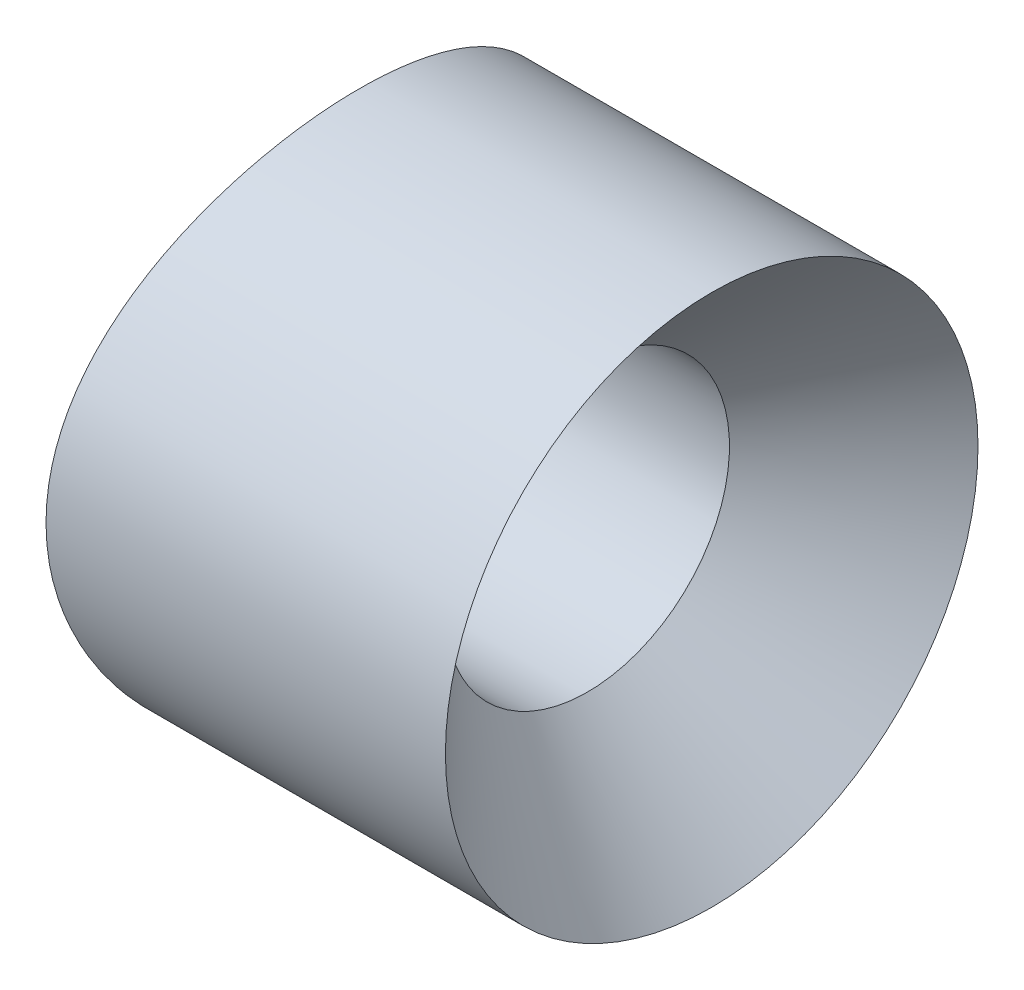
ISO-10303-21;
HEADER;
FILE_DESCRIPTION(('STEP AP214'),'2;1');
FILE_NAME('part.step','',(''),(''),'','','');
FILE_SCHEMA(('AUTOMOTIVE_DESIGN { 1 0 10303 214 1 1 1 1 }'));
ENDSEC;
DATA;
#1=APPLICATION_CONTEXT('core data for automotive mechanical design processes');
#2=APPLICATION_PROTOCOL_DEFINITION('international standard','automotive_design',2000,#1);
#3=PRODUCT_CONTEXT('',#1,'mechanical');
#4=PRODUCT('Part','Part','',(#3));
#5=PRODUCT_RELATED_PRODUCT_CATEGORY('part','',(#4));
#6=PRODUCT_DEFINITION_FORMATION('','',#4);
#7=PRODUCT_DEFINITION_CONTEXT('part definition',#1,'design');
#8=PRODUCT_DEFINITION('design','',#6,#7);
#9=PRODUCT_DEFINITION_SHAPE('','',#8);
#10=(LENGTH_UNIT() NAMED_UNIT(*) SI_UNIT(.MILLI.,.METRE.));
#11=(NAMED_UNIT(*) PLANE_ANGLE_UNIT() SI_UNIT($,.RADIAN.));
#12=(NAMED_UNIT(*) SI_UNIT($,.STERADIAN.) SOLID_ANGLE_UNIT());
#13=UNCERTAINTY_MEASURE_WITH_UNIT(LENGTH_MEASURE(1.E-05),#10,'distance_accuracy_value','');
#14=(GEOMETRIC_REPRESENTATION_CONTEXT(3) GLOBAL_UNCERTAINTY_ASSIGNED_CONTEXT((#13)) GLOBAL_UNIT_ASSIGNED_CONTEXT((#10,
#11,#12)) REPRESENTATION_CONTEXT('',''));
#15=CARTESIAN_POINT('',(0.,0.,0.));
#16=DIRECTION('',(0.,0.,1.));
#17=DIRECTION('',(1.,0.,0.));
#18=AXIS2_PLACEMENT_3D('',#15,#16,#17);
#19=CARTESIAN_POINT('',(0.,0.,0.));
#20=DIRECTION('',(-1.,0.,0.));
#21=DIRECTION('',(0.,0.,1.));
#22=AXIS2_PLACEMENT_3D('',#19,#20,#21);
#23=CYLINDRICAL_SURFACE('',#22,3.);
#24=CARTESIAN_POINT('',(0.,0.,3.));
#25=CARTESIAN_POINT('',(-1.24782056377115E-06,-0.163165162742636,3.00000157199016));
#26=CARTESIAN_POINT('',(0.00487986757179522,-0.326319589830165,2.98664366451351));
#27=CARTESIAN_POINT('',(0.023769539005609,-0.647779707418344,2.93375586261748));
#28=CARTESIAN_POINT('',(0.037779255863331,-0.806084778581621,2.89422263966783));
#29=CARTESIAN_POINT('',(0.0731588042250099,-1.11313423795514,2.7905463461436));
#30=CARTESIAN_POINT('',(0.0945136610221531,-1.2618973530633,2.72645331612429));
#31=CARTESIAN_POINT('',(0.142155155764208,-1.54660971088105,2.57564891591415));
#32=CARTESIAN_POINT('',(0.168442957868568,-1.68255591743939,2.488932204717));
#33=CARTESIAN_POINT('',(0.224195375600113,-1.94334201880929,2.29153844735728));
#34=CARTESIAN_POINT('',(0.253741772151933,-2.06758095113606,2.18009034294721));
#35=CARTESIAN_POINT('',(0.311992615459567,-2.29601754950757,1.93804128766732));
#36=CARTESIAN_POINT('',(0.340696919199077,-2.40021182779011,1.80743710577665));
#37=CARTESIAN_POINT('',(0.394980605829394,-2.58835703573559,1.52635966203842));
#38=CARTESIAN_POINT('',(0.420452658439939,-2.67167420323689,1.37543961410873));
#39=CARTESIAN_POINT('',(0.464434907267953,-2.81149862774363,1.06070810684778));
#40=CARTESIAN_POINT('',(0.482947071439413,-2.86801346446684,0.896900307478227));
#41=CARTESIAN_POINT('',(0.510344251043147,-2.95057902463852,0.567347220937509));
#42=CARTESIAN_POINT('',(0.519554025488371,-2.97766012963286,0.401887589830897));
#43=CARTESIAN_POINT('',(0.528463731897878,-3.00387011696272,0.0685334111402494));
#44=CARTESIAN_POINT('',(0.528166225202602,-3.00300652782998,-0.0993604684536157));
#45=CARTESIAN_POINT('',(0.518312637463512,-2.97399594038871,-0.425508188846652));
#46=CARTESIAN_POINT('',(0.509136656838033,-2.94696900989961,-0.583875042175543));
#47=CARTESIAN_POINT('',(0.483038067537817,-2.86825669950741,-0.89367358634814));
#48=CARTESIAN_POINT('',(0.466114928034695,-2.81656962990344,-1.04510480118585));
#49=CARTESIAN_POINT('',(0.425949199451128,-2.68937437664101,-1.33913205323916));
#50=CARTESIAN_POINT('',(0.40262471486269,-2.61355530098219,-1.48158195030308));
#51=CARTESIAN_POINT('',(0.352072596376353,-2.44050742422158,-1.75206150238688));
#52=CARTESIAN_POINT('',(0.324843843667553,-2.34327248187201,-1.88008700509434));
#53=CARTESIAN_POINT('',(0.267764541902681,-2.12455058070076,-2.12473739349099));
#54=CARTESIAN_POINT('',(0.237850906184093,-2.00210720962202,-2.24049377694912));
#55=CARTESIAN_POINT('',(0.179890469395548,-1.73930295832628,-2.45011918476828));
#56=CARTESIAN_POINT('',(0.151843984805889,-1.59893905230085,-2.54398450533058));
#57=CARTESIAN_POINT('',(0.100438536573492,-1.30141077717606,-2.70844134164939));
#58=CARTESIAN_POINT('',(0.0771590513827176,-1.14401953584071,-2.77864916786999));
#59=CARTESIAN_POINT('',(0.0388417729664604,-0.818653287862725,-2.89126400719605));
#60=CARTESIAN_POINT('',(0.0238003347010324,-0.650682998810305,-2.9336833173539));
#61=CARTESIAN_POINT('',(0.00449299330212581,-0.317371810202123,-2.98771308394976));
#62=CARTESIAN_POINT('',(-0.000245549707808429,-0.152277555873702,-3.0006761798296));
#63=CARTESIAN_POINT('',(0.000265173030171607,0.17776029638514,-2.99926970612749));
#64=CARTESIAN_POINT('',(0.00551251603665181,0.342703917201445,-2.9849053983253));
#65=CARTESIAN_POINT('',(0.0249309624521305,0.661474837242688,-2.93046946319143));
#66=CARTESIAN_POINT('',(0.0387693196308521,0.815488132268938,-2.8913553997));
#67=CARTESIAN_POINT('',(0.0734394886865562,1.11472845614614,-2.78968886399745));
#68=CARTESIAN_POINT('',(0.0942725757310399,1.25995387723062,-2.72713211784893));
#69=CARTESIAN_POINT('',(0.14143024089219,1.54277896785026,-2.57802720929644));
#70=CARTESIAN_POINT('',(0.16791255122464,1.67997217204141,-2.49075931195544));
#71=CARTESIAN_POINT('',(0.223086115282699,1.93825512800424,-2.29551598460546));
#72=CARTESIAN_POINT('',(0.251778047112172,2.05933990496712,-2.18753418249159));
#73=CARTESIAN_POINT('',(0.309897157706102,2.28831731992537,-1.94743170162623));
#74=CARTESIAN_POINT('',(0.339287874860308,2.39523002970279,-1.81436483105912));
#75=CARTESIAN_POINT('',(0.39406560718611,2.58528122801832,-1.531454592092));
#76=CARTESIAN_POINT('',(0.419452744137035,2.66842043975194,-1.38161173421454));
#77=CARTESIAN_POINT('',(0.463257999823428,2.80782850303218,-1.07006091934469));
#78=CARTESIAN_POINT('',(0.481718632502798,2.86426184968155,-0.908432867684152));
#79=CARTESIAN_POINT('',(0.509771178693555,2.94889793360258,-0.577222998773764));
#80=CARTESIAN_POINT('',(0.51936645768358,2.97711138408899,-0.407644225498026));
#81=CARTESIAN_POINT('',(0.528341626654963,3.0035080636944,-0.0742898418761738));
#82=CARTESIAN_POINT('',(0.52819907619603,3.00309516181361,0.0893629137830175));
#83=CARTESIAN_POINT('',(0.518902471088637,2.97573966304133,0.41415882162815));
#84=CARTESIAN_POINT('',(0.509749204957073,2.94879938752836,0.575302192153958));
#85=CARTESIAN_POINT('',(0.483642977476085,2.87009705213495,0.887726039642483));
#86=CARTESIAN_POINT('',(0.466827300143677,2.81877123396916,1.03912870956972));
#87=CARTESIAN_POINT('',(0.427129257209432,2.693163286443,1.33122524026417));
#88=CARTESIAN_POINT('',(0.404245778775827,2.61887694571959,1.47191713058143));
#89=CARTESIAN_POINT('',(0.353676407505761,2.44621457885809,1.74442926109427));
#90=CARTESIAN_POINT('',(0.325841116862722,2.34703071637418,1.87570954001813));
#91=CARTESIAN_POINT('',(0.268842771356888,2.1287445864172,2.12021781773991));
#92=CARTESIAN_POINT('',(0.239679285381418,2.00963581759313,2.23343990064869));
#93=CARTESIAN_POINT('',(0.181864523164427,1.74898006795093,2.44340220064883));
#94=CARTESIAN_POINT('',(0.153284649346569,1.60670738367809,2.53926413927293));
#95=CARTESIAN_POINT('',(0.101339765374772,1.30717474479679,2.70566588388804));
#96=CARTESIAN_POINT('',(0.0779736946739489,1.14991784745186,2.77621084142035));
#97=CARTESIAN_POINT('',(0.040017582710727,0.829587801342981,2.88784993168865));
#98=CARTESIAN_POINT('',(0.025185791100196,0.66682963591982,2.92976238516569));
#99=CARTESIAN_POINT('',(0.00517952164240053,0.336042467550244,2.98583120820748));
#100=CARTESIAN_POINT('',(1.28491428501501E-06,0.168015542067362,2.9999983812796));
#101=CARTESIAN_POINT('',(0.,0.,3.));
#102=B_SPLINE_CURVE_WITH_KNOTS('',3,(#24,#25,#26,#27,#28,#29,#30,#31,#32,#33,#34,#35,#36,#37,
#38,#39,#40,#41,#42,#43,#44,#45,#46,#47,#48,#49,#50,#51,#52,#53,#54,#55,#56,#57,#58,#59,#60,#61,
#62,#63,#64,#65,#66,#67,#68,#69,#70,#71,#72,#73,#74,#75,#76,#77,#78,#79,#80,#81,#82,#83,#84,#85,
#86,#87,#88,#89,#90,#91,#92,#93,#94,#95,#96,#97,#98,#99,#100,#101),.UNSPECIFIED.,.T.,.F.,(4,2,2,
2,2,2,2,2,2,2,2,2,2,2,2,2,2,2,2,2,2,2,2,2,2,2,2,2,2,2,2,2,2,2,2,2,2,2,4),(0.,0.488872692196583,
0.977807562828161,1.46575148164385,1.95381069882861,2.46001835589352,2.96631149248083,
3.48649402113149,4.00652935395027,4.50770706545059,5.0087497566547,5.48924976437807,
5.96978270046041,6.45677555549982,6.94390824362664,7.45496090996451,7.96609997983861,
8.48516940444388,9.00400897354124,9.49849543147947,9.99288668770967,10.4692306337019,
10.9456614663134,11.4377220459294,11.9299342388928,12.4470984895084,12.9642470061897,
13.4781672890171,13.9918923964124,14.4804425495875,14.9689499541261,15.4490296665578,
15.929197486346,16.4276038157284,16.9261730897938,17.4454191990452,17.9645595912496,
18.4681610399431,18.9715663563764),.UNSPECIFIED.);
#103=CARTESIAN_POINT('',(0.,0.,3.));
#104=VERTEX_POINT('',#103);
#105=EDGE_CURVE('E46',#104,#104,#102,.T.);
#106=ORIENTED_EDGE('',*,*,#105,.T.);
#107=EDGE_LOOP('',(#106));
#108=FACE_BOUND('',#107,.T.);
#109=CARTESIAN_POINT('',(4.5,0.,0.));
#110=DIRECTION('',(-1.,0.,0.));
#111=DIRECTION('',(0.,0.,1.));
#112=AXIS2_PLACEMENT_3D('',#109,#110,#111);
#113=CIRCLE('',#112,3.);
#114=CARTESIAN_POINT('',(4.5,0.,3.));
#115=VERTEX_POINT('',#114);
#116=EDGE_CURVE('E10',#115,#115,#113,.T.);
#117=ORIENTED_EDGE('',*,*,#116,.T.);
#118=EDGE_LOOP('',(#117));
#119=FACE_BOUND('',#118,.T.);
#120=ADVANCED_FACE('F30',(#108,#119),#23,.T.);
#121=CARTESIAN_POINT('',(3.10000000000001,0.,0.));
#122=DIRECTION('',(1.,0.,0.));
#123=DIRECTION('',(0.,0.,-1.));
#124=AXIS2_PLACEMENT_3D('',#121,#122,#123);
#125=CONICAL_SURFACE('',#124,1.6,0.78539816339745);
#126=ORIENTED_EDGE('',*,*,#116,.F.);
#127=EDGE_LOOP('',(#126));
#128=FACE_BOUND('',#127,.T.);
#129=CARTESIAN_POINT('',(3.10000000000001,0.,0.));
#130=DIRECTION('',(-1.,0.,0.));
#131=DIRECTION('',(0.,0.,1.));
#132=AXIS2_PLACEMENT_3D('',#129,#130,#131);
#133=CIRCLE('',#132,1.6);
#134=CARTESIAN_POINT('',(3.10000000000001,0.,1.6));
#135=VERTEX_POINT('',#134);
#136=EDGE_CURVE('E42',#135,#135,#133,.T.);
#137=ORIENTED_EDGE('',*,*,#136,.T.);
#138=EDGE_LOOP('',(#137));
#139=FACE_BOUND('',#138,.T.);
#140=ADVANCED_FACE('F60',(#128,#139),#125,.F.);
#141=CARTESIAN_POINT('',(0.,0.,0.));
#142=DIRECTION('',(-1.,0.,0.));
#143=DIRECTION('',(0.,0.,1.));
#144=AXIS2_PLACEMENT_3D('',#141,#142,#143);
#145=CYLINDRICAL_SURFACE('',#144,1.6);
#146=CARTESIAN_POINT('',(0.380475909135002,0.,1.6));
#147=CARTESIAN_POINT('',(0.380477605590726,0.0890720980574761,1.59999653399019));
#148=CARTESIAN_POINT('',(0.381866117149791,0.178189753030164,1.59253680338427));
#149=CARTESIAN_POINT('',(0.387263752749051,0.353915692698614,1.56291305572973));
#150=CARTESIAN_POINT('',(0.391275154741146,0.440521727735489,1.54073625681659));
#151=CARTESIAN_POINT('',(0.401449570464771,0.608656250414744,1.48237895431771));
#152=CARTESIAN_POINT('',(0.407610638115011,0.690189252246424,1.44621111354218));
#153=CARTESIAN_POINT('',(0.421387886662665,0.846023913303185,1.36093140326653));
#154=CARTESIAN_POINT('',(0.429003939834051,0.920326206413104,1.31182066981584));
#155=CARTESIAN_POINT('',(0.444932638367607,1.0604667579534,1.20143619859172));
#156=CARTESIAN_POINT('',(0.453251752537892,1.12620805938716,1.14004028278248));
#157=CARTESIAN_POINT('',(0.469591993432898,1.24651645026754,1.00709231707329));
#158=CARTESIAN_POINT('',(0.477613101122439,1.3010828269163,0.935539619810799));
#159=CARTESIAN_POINT('',(0.49252263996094,1.39786185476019,0.783674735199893));
#160=CARTESIAN_POINT('',(0.499402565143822,1.43998341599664,0.70330359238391));
#161=CARTESIAN_POINT('',(0.511182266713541,1.51009066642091,0.536479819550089));
#162=CARTESIAN_POINT('',(0.516082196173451,1.53807744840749,0.450027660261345));
#163=CARTESIAN_POINT('',(0.523304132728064,1.57882178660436,0.274499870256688));
#164=CARTESIAN_POINT('',(0.525653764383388,1.59174265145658,0.185463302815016));
#165=CARTESIAN_POINT('',(0.527605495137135,1.60249693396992,0.0064571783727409));
#166=CARTESIAN_POINT('',(0.527207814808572,1.60033156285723,-0.0835123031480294));
#167=CARTESIAN_POINT('',(0.523731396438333,1.58110068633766,-0.260711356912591));
#168=CARTESIAN_POINT('',(0.520684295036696,1.56421099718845,-0.347960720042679));
#169=CARTESIAN_POINT('',(0.512286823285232,1.5162886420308,-0.518365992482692));
#170=CARTESIAN_POINT('',(0.506936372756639,1.48525548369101,-0.601521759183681));
#171=CARTESIAN_POINT('',(0.494480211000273,1.40975755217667,-0.761892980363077));
#172=CARTESIAN_POINT('',(0.487365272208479,1.36522188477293,-0.839074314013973));
#173=CARTESIAN_POINT('',(0.472168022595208,1.26403528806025,-0.984934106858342));
#174=CARTESIAN_POINT('',(0.464085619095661,1.2073831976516,-1.05361175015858));
#175=CARTESIAN_POINT('',(0.447712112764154,1.08260123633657,-1.18155556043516));
#176=CARTESIAN_POINT('',(0.439419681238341,1.01431758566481,-1.24067167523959));
#177=CARTESIAN_POINT('',(0.423672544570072,0.868724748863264,-1.34663417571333));
#178=CARTESIAN_POINT('',(0.416217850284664,0.791415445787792,-1.39348040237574));
#179=CARTESIAN_POINT('',(0.402988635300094,0.629773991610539,-1.47361230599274));
#180=CARTESIAN_POINT('',(0.397216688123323,0.545431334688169,-1.50687724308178));
#181=CARTESIAN_POINT('',(0.388046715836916,0.372226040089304,-1.55872301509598));
#182=CARTESIAN_POINT('',(0.384648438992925,0.283363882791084,-1.5773054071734));
#183=CARTESIAN_POINT('',(0.380660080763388,0.104992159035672,-1.59904174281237));
#184=CARTESIAN_POINT('',(0.380030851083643,0.0155096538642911,-1.60241078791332));
#185=CARTESIAN_POINT('',(0.381547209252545,-0.162739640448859,-1.5942004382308));
#186=CARTESIAN_POINT('',(0.383692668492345,-0.251506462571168,-1.58262173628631));
#187=CARTESIAN_POINT('',(0.39048028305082,-0.425104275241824,-1.54502887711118));
#188=CARTESIAN_POINT('',(0.395103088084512,-0.509960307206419,-1.51912655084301));
#189=CARTESIAN_POINT('',(0.406307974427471,-0.674127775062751,-1.45373998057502));
#190=CARTESIAN_POINT('',(0.412890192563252,-0.753438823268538,-1.41425478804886));
#191=CARTESIAN_POINT('',(0.427361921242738,-0.905215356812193,-1.32232468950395));
#192=CARTESIAN_POINT('',(0.435264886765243,-0.977596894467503,-1.26974334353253));
#193=CARTESIAN_POINT('',(0.451449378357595,-1.1125869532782,-1.15329843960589));
#194=CARTESIAN_POINT('',(0.459730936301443,-1.17519464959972,-1.0894339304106));
#195=CARTESIAN_POINT('',(0.475864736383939,-1.28965827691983,-0.951277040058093));
#196=CARTESIAN_POINT('',(0.483710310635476,-1.34136988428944,-0.876864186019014));
#197=CARTESIAN_POINT('',(0.497977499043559,-1.4315570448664,-0.720282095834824));
#198=CARTESIAN_POINT('',(0.504399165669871,-1.47003308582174,-0.63811314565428));
#199=CARTESIAN_POINT('',(0.515066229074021,-1.53243843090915,-0.468758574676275));
#200=CARTESIAN_POINT('',(0.519322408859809,-1.55643992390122,-0.38160026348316));
#201=CARTESIAN_POINT('',(0.525224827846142,-1.58944587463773,-0.204405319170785));
#202=CARTESIAN_POINT('',(0.526871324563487,-1.59845181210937,-0.114368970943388));
#203=CARTESIAN_POINT('',(0.527364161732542,-1.60116201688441,0.0646396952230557));
#204=CARTESIAN_POINT('',(0.526250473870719,-1.59508471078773,0.153608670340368));
#205=CARTESIAN_POINT('',(0.52143071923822,-1.56827764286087,0.329235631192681));
#206=CARTESIAN_POINT('',(0.517724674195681,-1.54754800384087,0.415893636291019));
#207=CARTESIAN_POINT('',(0.508136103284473,-1.49211447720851,0.584332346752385));
#208=CARTESIAN_POINT('',(0.502256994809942,-1.45743252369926,0.666120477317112));
#209=CARTESIAN_POINT('',(0.488960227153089,-1.37510447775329,0.822749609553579));
#210=CARTESIAN_POINT('',(0.481542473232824,-1.32745758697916,0.897590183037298));
#211=CARTESIAN_POINT('',(0.465861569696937,-1.21979388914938,1.03929167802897));
#212=CARTESIAN_POINT('',(0.457588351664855,-1.15961864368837,1.10603111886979));
#213=CARTESIAN_POINT('',(0.441194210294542,-1.02893638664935,1.22854097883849));
#214=CARTESIAN_POINT('',(0.433073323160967,-0.95842695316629,1.28430881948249));
#215=CARTESIAN_POINT('',(0.417827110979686,-0.808352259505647,1.38374137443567));
#216=CARTESIAN_POINT('',(0.410710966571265,-0.728714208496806,1.42729766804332));
#217=CARTESIAN_POINT('',(0.398389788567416,-0.563149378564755,1.50034447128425));
#218=CARTESIAN_POINT('',(0.393182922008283,-0.477228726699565,1.52984847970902));
#219=CARTESIAN_POINT('',(0.386375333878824,-0.325858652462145,1.56783916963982));
#220=CARTESIAN_POINT('',(0.384175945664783,-0.261304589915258,1.57987919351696));
#221=CARTESIAN_POINT('',(0.381225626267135,-0.131175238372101,1.59596078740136));
#222=CARTESIAN_POINT('',(0.380474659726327,-0.065599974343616,1.60000255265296));
#223=CARTESIAN_POINT('',(0.380475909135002,0.,1.6));
#224=B_SPLINE_CURVE_WITH_KNOTS('',3,(#146,#147,#148,#149,#150,#151,#152,#153,#154,#155,#156,
#157,#158,#159,#160,#161,#162,#163,#164,#165,#166,#167,#168,#169,#170,#171,#172,#173,#174,#175,
#176,#177,#178,#179,#180,#181,#182,#183,#184,#185,#186,#187,#188,#189,#190,#191,#192,#193,#194,
#195,#196,#197,#198,#199,#200,#201,#202,#203,#204,#205,#206,#207,#208,#209,#210,#211,#212,#213,
#214,#215,#216,#217,#218,#219,#220,#221,#222,#223),.UNSPECIFIED.,.T.,.F.,(4,2,2,2,2,2,2,2,2,2,2,
2,2,2,2,2,2,2,2,2,2,2,2,2,2,2,2,2,2,2,2,2,2,2,2,2,2,2,4),(0.,0.266976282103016,
0.534184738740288,0.801151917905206,1.06809567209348,1.33783948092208,1.60760049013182,
1.87928970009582,2.15095790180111,2.4196531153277,2.68832675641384,2.95383556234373,
3.2193536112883,3.48629062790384,3.75325323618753,4.02406680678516,4.29488388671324,
4.56611299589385,4.83731333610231,5.10466691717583,5.37200810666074,5.63729092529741,
5.9025922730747,6.17078256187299,6.43899547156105,6.71056418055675,6.98212288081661,
7.25231578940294,7.522482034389,7.78875878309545,8.05503329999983,8.32089083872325,
8.58676475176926,8.85623103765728,9.12576057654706,9.39761238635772,9.66920252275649,
9.86583048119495,10.0624536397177),.UNSPECIFIED.);
#225=CARTESIAN_POINT('',(0.380475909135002,0.,1.6));
#226=VERTEX_POINT('',#225);
#227=EDGE_CURVE('E34',#226,#226,#224,.T.);
#228=ORIENTED_EDGE('',*,*,#227,.T.);
#229=EDGE_LOOP('',(#228));
#230=FACE_BOUND('',#229,.T.);
#231=ORIENTED_EDGE('',*,*,#136,.F.);
#232=EDGE_LOOP('',(#231));
#233=FACE_BOUND('',#232,.T.);
#234=ADVANCED_FACE('F55',(#230,#233),#145,.F.);
#235=CARTESIAN_POINT('',(-8.27284715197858,-23.5,0.));
#236=DIRECTION('',(0.,1.,0.));
#237=DIRECTION('',(0.,0.,1.));
#238=AXIS2_PLACEMENT_3D('',#235,#236,#237);
#239=CYLINDRICAL_SURFACE('',#238,8.8);
#240=ORIENTED_EDGE('',*,*,#227,.F.);
#241=EDGE_LOOP('',(#240));
#242=FACE_BOUND('',#241,.T.);
#243=ORIENTED_EDGE('',*,*,#105,.F.);
#244=EDGE_LOOP('',(#243));
#245=FACE_BOUND('',#244,.T.);
#246=ADVANCED_FACE('F52',(#242,#245),#239,.F.);
#247=CLOSED_SHELL('',(#120,#140,#234,#246));
#248=MANIFOLD_SOLID_BREP('B2',#247);
#249=ADVANCED_BREP_SHAPE_REPRESENTATION('',(#18,#248),#14);
#250=SHAPE_DEFINITION_REPRESENTATION(#9,#249);
ENDSEC;
END-ISO-10303-21;
